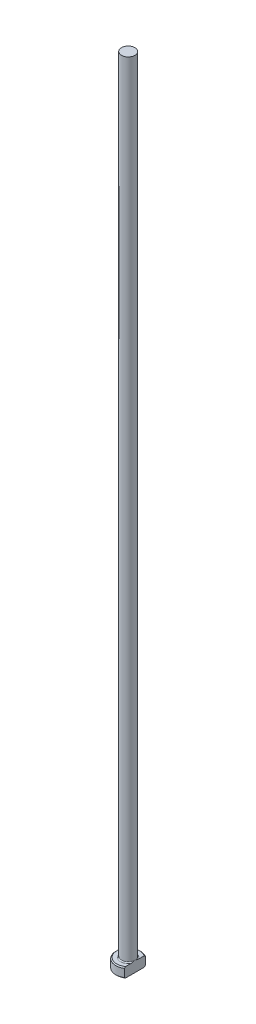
ISO-10303-21;
HEADER;
FILE_DESCRIPTION(('STEP AP214'),'2;1');
FILE_NAME('part.step','',(''),(''),'','','');
FILE_SCHEMA(('AUTOMOTIVE_DESIGN { 1 0 10303 214 1 1 1 1 }'));
ENDSEC;
DATA;
#1=APPLICATION_CONTEXT('core data for automotive mechanical design processes');
#2=APPLICATION_PROTOCOL_DEFINITION('international standard','automotive_design',2000,#1);
#3=PRODUCT_CONTEXT('',#1,'mechanical');
#4=PRODUCT('Part','Part','',(#3));
#5=PRODUCT_RELATED_PRODUCT_CATEGORY('part','',(#4));
#6=PRODUCT_DEFINITION_FORMATION('','',#4);
#7=PRODUCT_DEFINITION_CONTEXT('part definition',#1,'design');
#8=PRODUCT_DEFINITION('design','',#6,#7);
#9=PRODUCT_DEFINITION_SHAPE('','',#8);
#10=(LENGTH_UNIT() NAMED_UNIT(*) SI_UNIT(.MILLI.,.METRE.));
#11=(NAMED_UNIT(*) PLANE_ANGLE_UNIT() SI_UNIT($,.RADIAN.));
#12=(NAMED_UNIT(*) SI_UNIT($,.STERADIAN.) SOLID_ANGLE_UNIT());
#13=UNCERTAINTY_MEASURE_WITH_UNIT(LENGTH_MEASURE(1.E-05),#10,'distance_accuracy_value','');
#14=(GEOMETRIC_REPRESENTATION_CONTEXT(3) GLOBAL_UNCERTAINTY_ASSIGNED_CONTEXT((#13)) GLOBAL_UNIT_ASSIGNED_CONTEXT((#10,
#11,#12)) REPRESENTATION_CONTEXT('',''));
#15=CARTESIAN_POINT('',(0.,0.,0.));
#16=DIRECTION('',(0.,0.,1.));
#17=DIRECTION('',(1.,0.,0.));
#18=AXIS2_PLACEMENT_3D('',#15,#16,#17);
#19=CARTESIAN_POINT('',(0.,0.,0.));
#20=DIRECTION('',(0.,-1.,0.));
#21=DIRECTION('',(0.,0.,-1.));
#22=AXIS2_PLACEMENT_3D('',#19,#20,#21);
#23=PLANE('',#22);
#24=CARTESIAN_POINT('',(0.,0.,0.));
#25=DIRECTION('',(0.,-1.,0.));
#26=DIRECTION('',(0.,0.,-1.));
#27=AXIS2_PLACEMENT_3D('',#24,#25,#26);
#28=CIRCLE('',#27,2.29999999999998);
#29=CARTESIAN_POINT('',(1.34999999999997,0.,1.86212244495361));
#30=VERTEX_POINT('',#29);
#31=CARTESIAN_POINT('',(1.34999999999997,0.,-1.86212244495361));
#32=VERTEX_POINT('',#31);
#33=EDGE_CURVE('E98',#30,#32,#28,.T.);
#34=ORIENTED_EDGE('',*,*,#33,.T.);
#35=DIRECTION('',(0.,0.,1.));
#36=VECTOR('',#35,1.);
#37=CARTESIAN_POINT('',(1.34999999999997,0.,-2.10416254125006));
#38=LINE('',#37,#36);
#39=EDGE_CURVE('E83',#32,#30,#38,.T.);
#40=ORIENTED_EDGE('',*,*,#39,.T.);
#41=EDGE_LOOP('',(#34,#40));
#42=FACE_BOUND('',#41,.T.);
#43=ADVANCED_FACE('F32',(#42),#23,.T.);
#44=CARTESIAN_POINT('',(0.,259.958771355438,0.));
#45=DIRECTION('',(0.,1.,0.));
#46=DIRECTION('',(0.,0.,1.));
#47=AXIS2_PLACEMENT_3D('',#44,#45,#46);
#48=CYLINDRICAL_SURFACE('',#47,2.49999999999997);
#49=CARTESIAN_POINT('',(0.,1.79999999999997,0.));
#50=DIRECTION('',(0.,1.,0.));
#51=DIRECTION('',(0.,0.,1.));
#52=AXIS2_PLACEMENT_3D('',#49,#50,#51);
#53=CIRCLE('',#52,2.49999999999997);
#54=CARTESIAN_POINT('',(1.34999999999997,1.79999999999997,2.10416254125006));
#55=VERTEX_POINT('',#54);
#56=CARTESIAN_POINT('',(1.34999999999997,1.79999999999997,-2.10416254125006));
#57=VERTEX_POINT('',#56);
#58=EDGE_CURVE('E104',#55,#57,#53,.F.);
#59=ORIENTED_EDGE('',*,*,#58,.T.);
#60=DIRECTION('',(0.,-1.,0.));
#61=VECTOR('',#60,1.);
#62=CARTESIAN_POINT('',(1.34999999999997,160.,-2.10416254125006));
#63=LINE('',#62,#61);
#64=CARTESIAN_POINT('',(1.34999999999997,0.199999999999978,-2.10416254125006));
#65=VERTEX_POINT('',#64);
#66=EDGE_CURVE('E183',#57,#65,#63,.T.);
#67=ORIENTED_EDGE('',*,*,#66,.T.);
#68=CARTESIAN_POINT('',(0.,0.199999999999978,0.));
#69=DIRECTION('',(0.,-1.,0.));
#70=DIRECTION('',(0.,0.,-1.));
#71=AXIS2_PLACEMENT_3D('',#68,#69,#70);
#72=CIRCLE('',#71,2.49999999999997);
#73=CARTESIAN_POINT('',(1.34999999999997,0.199999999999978,2.10416254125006));
#74=VERTEX_POINT('',#73);
#75=EDGE_CURVE('E100',#65,#74,#72,.F.);
#76=ORIENTED_EDGE('',*,*,#75,.T.);
#77=DIRECTION('',(0.,-1.,0.));
#78=VECTOR('',#77,1.);
#79=CARTESIAN_POINT('',(1.34999999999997,160.,2.10416254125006));
#80=LINE('',#79,#78);
#81=EDGE_CURVE('E93',#55,#74,#80,.T.);
#82=ORIENTED_EDGE('',*,*,#81,.F.);
#83=EDGE_LOOP('',(#59,#67,#76,#82));
#84=FACE_BOUND('',#83,.T.);
#85=ADVANCED_FACE('F158',(#84),#48,.T.);
#86=CARTESIAN_POINT('',(-2.49999999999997,2.,0.));
#87=DIRECTION('',(0.,1.,0.));
#88=DIRECTION('',(0.,0.,1.));
#89=AXIS2_PLACEMENT_3D('',#86,#87,#88);
#90=PLANE('',#89);
#91=CARTESIAN_POINT('',(0.,2.,0.));
#92=DIRECTION('',(0.,1.,0.));
#93=DIRECTION('',(0.,0.,1.));
#94=AXIS2_PLACEMENT_3D('',#91,#92,#93);
#95=CIRCLE('',#94,2.29999999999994);
#96=CARTESIAN_POINT('',(1.34999999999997,2.,-1.86212244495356));
#97=VERTEX_POINT('',#96);
#98=CARTESIAN_POINT('',(1.34999999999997,2.,1.86212244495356));
#99=VERTEX_POINT('',#98);
#100=EDGE_CURVE('E178',#97,#99,#95,.T.);
#101=ORIENTED_EDGE('',*,*,#100,.T.);
#102=DIRECTION('',(0.,0.,-1.));
#103=VECTOR('',#102,1.);
#104=CARTESIAN_POINT('',(1.34999999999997,2.,0.));
#105=LINE('',#104,#103);
#106=CARTESIAN_POINT('',(1.34999999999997,1.99999999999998,0.761577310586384));
#107=VERTEX_POINT('',#106);
#108=EDGE_CURVE('E57',#99,#107,#105,.T.);
#109=ORIENTED_EDGE('',*,*,#108,.T.);
#110=CARTESIAN_POINT('',(0.,2.,0.));
#111=DIRECTION('',(0.,1.,0.));
#112=DIRECTION('',(0.,0.,1.));
#113=AXIS2_PLACEMENT_3D('',#110,#111,#112);
#114=CIRCLE('',#113,1.54999999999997);
#115=CARTESIAN_POINT('',(1.34999999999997,1.99999999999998,-0.761577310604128));
#116=VERTEX_POINT('',#115);
#117=EDGE_CURVE('E107',#107,#116,#114,.F.);
#118=ORIENTED_EDGE('',*,*,#117,.T.);
#119=EDGE_CURVE('E136',#116,#97,#105,.T.);
#120=ORIENTED_EDGE('',*,*,#119,.T.);
#121=EDGE_LOOP('',(#101,#109,#118,#120));
#122=FACE_BOUND('',#121,.T.);
#123=ADVANCED_FACE('F147',(#122),#90,.T.);
#124=CARTESIAN_POINT('',(0.,2.,0.));
#125=DIRECTION('',(0.,-1.,0.));
#126=DIRECTION('',(0.,0.,-1.));
#127=AXIS2_PLACEMENT_3D('',#124,#125,#126);
#128=CONICAL_SURFACE('',#127,2.29999999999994,0.785398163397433);
#129=ORIENTED_EDGE('',*,*,#58,.F.);
#130=CARTESIAN_POINT('',(1.34999999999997,-0.524919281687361,4.63220747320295));
#131=CARTESIAN_POINT('',(1.34999999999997,-0.437609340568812,4.54126266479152));
#132=CARTESIAN_POINT('',(1.34999999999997,-0.350401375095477,4.45021982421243));
#133=CARTESIAN_POINT('',(1.34999999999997,-0.176235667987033,4.26789371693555));
#134=CARTESIAN_POINT('',(1.34999999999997,-0.0892779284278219,4.17661044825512));
#135=CARTESIAN_POINT('',(1.34999999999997,0.171198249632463,3.90228319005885));
#136=CARTESIAN_POINT('',(1.34999999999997,0.344269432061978,3.71881394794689));
#137=CARTESIAN_POINT('',(1.34999999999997,0.686339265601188,3.35265578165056));
#138=CARTESIAN_POINT('',(1.34999999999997,0.855361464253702,3.16998895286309));
#139=CARTESIAN_POINT('',(1.34999999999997,1.10676804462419,2.89407002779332));
#140=CARTESIAN_POINT('',(1.34999999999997,1.19021072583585,2.80178299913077));
#141=CARTESIAN_POINT('',(1.34999999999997,1.35616107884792,2.61637299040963));
#142=CARTESIAN_POINT('',(1.34999999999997,1.43866876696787,2.52325002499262));
#143=CARTESIAN_POINT('',(1.34999999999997,1.58666506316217,2.35393986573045));
#144=CARTESIAN_POINT('',(1.34999999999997,1.65237203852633,2.27794381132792));
#145=CARTESIAN_POINT('',(1.34999999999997,1.78272599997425,2.12503384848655));
#146=CARTESIAN_POINT('',(1.34999999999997,1.8473728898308,2.04811985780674));
#147=CARTESIAN_POINT('',(1.34999999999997,1.97578051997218,1.89247191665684));
#148=CARTESIAN_POINT('',(1.34999999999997,2.03952939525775,1.81372814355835));
#149=CARTESIAN_POINT('',(1.34999999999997,2.16502964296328,1.6546866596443));
#150=CARTESIAN_POINT('',(1.34999999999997,2.22678149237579,1.57438932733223));
#151=CARTESIAN_POINT('',(1.34999999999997,2.34821109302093,1.41068778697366));
#152=CARTESIAN_POINT('',(1.34999999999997,2.40785394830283,1.32725749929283));
#153=CARTESIAN_POINT('',(1.34999999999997,2.52292072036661,1.15733795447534));
#154=CARTESIAN_POINT('',(1.34999999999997,2.57833930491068,1.07084502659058));
#155=CARTESIAN_POINT('',(1.34999999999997,2.68200172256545,0.894688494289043));
#156=CARTESIAN_POINT('',(1.34999999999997,2.73030792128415,0.805062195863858));
#157=CARTESIAN_POINT('',(1.34999999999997,2.81628592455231,0.620872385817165));
#158=CARTESIAN_POINT('',(1.34999999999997,2.85398889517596,0.52632433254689));
#159=CARTESIAN_POINT('',(1.34999999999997,2.89712682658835,0.383943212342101));
#160=CARTESIAN_POINT('',(1.34999999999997,2.90904798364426,0.338082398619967));
#161=CARTESIAN_POINT('',(1.34999999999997,2.92861548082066,0.245444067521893));
#162=CARTESIAN_POINT('',(1.34999999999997,2.93626244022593,0.198666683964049));
#163=CARTESIAN_POINT('',(1.34999999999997,2.94673600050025,0.104809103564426));
#164=CARTESIAN_POINT('',(1.34999999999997,2.94958722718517,0.0577317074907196));
#165=CARTESIAN_POINT('',(1.34999999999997,2.95032901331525,-0.0364641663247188));
#166=CARTESIAN_POINT('',(1.34999999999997,2.94821949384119,-0.0835826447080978));
#167=CARTESIAN_POINT('',(1.34999999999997,2.93922391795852,-0.177115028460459));
#168=CARTESIAN_POINT('',(1.34999999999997,2.932361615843,-0.223531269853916));
#169=CARTESIAN_POINT('',(1.34999999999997,2.91435204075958,-0.315528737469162));
#170=CARTESIAN_POINT('',(1.34999999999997,2.90320298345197,-0.361109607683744));
#171=CARTESIAN_POINT('',(1.34999999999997,2.8771578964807,-0.451518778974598));
#172=CARTESIAN_POINT('',(1.34999999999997,2.86223608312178,-0.496339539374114));
#173=CARTESIAN_POINT('',(1.34999999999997,2.82934295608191,-0.584823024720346));
#174=CARTESIAN_POINT('',(1.34999999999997,2.81137212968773,-0.628485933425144));
#175=CARTESIAN_POINT('',(1.34999999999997,2.75847247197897,-0.747269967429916));
#176=CARTESIAN_POINT('',(1.34999999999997,2.7209858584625,-0.821247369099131));
#177=CARTESIAN_POINT('',(1.34999999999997,2.64086295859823,-0.96638321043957));
#178=CARTESIAN_POINT('',(1.34999999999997,2.59822112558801,-1.03753850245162));
#179=CARTESIAN_POINT('',(1.34999999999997,2.50923184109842,-1.17783613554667));
#180=CARTESIAN_POINT('',(1.34999999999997,2.46287145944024,-1.24697020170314));
#181=CARTESIAN_POINT('',(1.34999999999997,2.36764461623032,-1.38343072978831));
#182=CARTESIAN_POINT('',(1.34999999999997,2.31877921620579,-1.45075793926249));
#183=CARTESIAN_POINT('',(1.34999999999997,2.21858850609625,-1.58486082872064));
#184=CARTESIAN_POINT('',(1.34999999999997,2.16724014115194,-1.65161920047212));
#185=CARTESIAN_POINT('',(1.34999999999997,2.06312993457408,-1.78402712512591));
#186=CARTESIAN_POINT('',(1.34999999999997,2.01036799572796,-1.8496766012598));
#187=CARTESIAN_POINT('',(1.34999999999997,1.85072242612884,-2.04502635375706));
#188=CARTESIAN_POINT('',(1.34999999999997,1.74225068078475,-2.17342678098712));
#189=CARTESIAN_POINT('',(1.34999999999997,1.54426345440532,-2.4029598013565));
#190=CARTESIAN_POINT('',(1.34999999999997,1.45520943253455,-2.50449462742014));
#191=CARTESIAN_POINT('',(1.34999999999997,1.27587070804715,-2.7064765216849));
#192=CARTESIAN_POINT('',(1.34999999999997,1.18558597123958,-2.80692355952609));
#193=CARTESIAN_POINT('',(1.34999999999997,0.913238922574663,-3.10722245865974));
#194=CARTESIAN_POINT('',(1.34999999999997,0.729836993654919,-3.30585698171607));
#195=CARTESIAN_POINT('',(1.34999999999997,0.368419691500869,-3.6931549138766));
#196=CARTESIAN_POINT('',(1.34999999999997,0.190487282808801,-3.88189615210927));
#197=CARTESIAN_POINT('',(1.34999999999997,-0.0772724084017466,-4.16399820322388));
#198=CARTESIAN_POINT('',(1.34999999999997,-0.166621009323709,-4.2578138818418));
#199=CARTESIAN_POINT('',(1.34999999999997,-0.345583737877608,-4.44518993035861));
#200=CARTESIAN_POINT('',(1.34999999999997,-0.435197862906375,-4.53875030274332));
#201=CARTESIAN_POINT('',(1.34999999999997,-0.52491928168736,-4.63220747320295));
#202=B_SPLINE_CURVE_WITH_KNOTS('',3,(#130,#131,#132,#133,#134,#135,#136,#137,#138,#139,#140,
#141,#142,#143,#144,#145,#146,#147,#148,#149,#150,#151,#152,#153,#154,#155,#156,#157,#158,#159,
#160,#161,#162,#163,#164,#165,#166,#167,#168,#169,#170,#171,#172,#173,#174,#175,#176,#177,#178,
#179,#180,#181,#182,#183,#184,#185,#186,#187,#188,#189,#190,#191,#192,#193,#194,#195,#196,#197,
#198,#199,#200,#201),.UNSPECIFIED.,.F.,.F.,(4,2,2,2,2,2,2,2,2,2,2,2,2,2,2,2,2,2,2,2,2,2,2,2,2,2,
2,2,2,2,2,2,2,2,2,4),(0.,0.378214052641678,0.756431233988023,1.51308288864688,2.2596674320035,
2.63291386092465,3.00615376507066,3.30753536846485,3.60894417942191,3.91286335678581,
4.21670939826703,4.52429630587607,4.83226525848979,5.13734835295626,5.4415251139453,
5.58351223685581,5.72547878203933,5.86671408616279,6.00795163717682,6.14848833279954,
6.28908358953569,6.43066697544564,6.57222775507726,6.82069043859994,7.06942287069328,
7.31906118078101,7.56859456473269,7.82123528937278,8.07389343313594,8.57808208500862,
8.98323970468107,9.38840860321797,10.1994443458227,10.9776078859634,11.3662730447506,
11.7549344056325),.UNSPECIFIED.);
#203=EDGE_CURVE('E135',#55,#99,#202,.T.);
#204=ORIENTED_EDGE('',*,*,#203,.T.);
#205=ORIENTED_EDGE('',*,*,#100,.F.);
#206=EDGE_CURVE('E127',#97,#57,#202,.T.);
#207=ORIENTED_EDGE('',*,*,#206,.T.);
#208=EDGE_LOOP('',(#129,#204,#205,#207));
#209=FACE_BOUND('',#208,.T.);
#210=ADVANCED_FACE('F143',(#209),#128,.T.);
#211=CARTESIAN_POINT('',(0.,0.199999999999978,0.));
#212=DIRECTION('',(0.,1.,0.));
#213=DIRECTION('',(0.,0.,1.));
#214=AXIS2_PLACEMENT_3D('',#211,#212,#213);
#215=CONICAL_SURFACE('',#214,2.49999999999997,0.785398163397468);
#216=ORIENTED_EDGE('',*,*,#75,.F.);
#217=CARTESIAN_POINT('',(1.34999999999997,2.52491928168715,-4.63220747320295));
#218=CARTESIAN_POINT('',(1.34999999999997,2.4376093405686,-4.54126266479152));
#219=CARTESIAN_POINT('',(1.34999999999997,2.35040137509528,-4.45021982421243));
#220=CARTESIAN_POINT('',(1.34999999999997,2.17623566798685,-4.26789371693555));
#221=CARTESIAN_POINT('',(1.34999999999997,2.08927792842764,-4.17661044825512));
#222=CARTESIAN_POINT('',(1.34999999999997,1.82880175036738,-3.90228319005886));
#223=CARTESIAN_POINT('',(1.34999999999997,1.65573056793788,-3.7188139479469));
#224=CARTESIAN_POINT('',(1.34999999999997,1.3136607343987,-3.35265578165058));
#225=CARTESIAN_POINT('',(1.34999999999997,1.1446385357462,-3.16998895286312));
#226=CARTESIAN_POINT('',(1.34999999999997,0.89323195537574,-2.89407002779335));
#227=CARTESIAN_POINT('',(1.34999999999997,0.809789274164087,-2.8017829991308));
#228=CARTESIAN_POINT('',(1.34999999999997,0.64383892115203,-2.61637299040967));
#229=CARTESIAN_POINT('',(1.34999999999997,0.561331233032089,-2.52325002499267));
#230=CARTESIAN_POINT('',(1.34999999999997,0.413334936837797,-2.35393986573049));
#231=CARTESIAN_POINT('',(1.34999999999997,0.347627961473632,-2.27794381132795));
#232=CARTESIAN_POINT('',(1.34999999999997,0.217274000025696,-2.12503384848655));
#233=CARTESIAN_POINT('',(1.34999999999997,0.152627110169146,-2.04811985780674));
#234=CARTESIAN_POINT('',(1.34999999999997,0.0242194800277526,-1.89247191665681));
#235=CARTESIAN_POINT('',(1.34999999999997,-0.03952939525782,-1.8137281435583));
#236=CARTESIAN_POINT('',(1.34999999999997,-0.165029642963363,-1.65468665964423));
#237=CARTESIAN_POINT('',(1.34999999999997,-0.226781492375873,-1.57438932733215));
#238=CARTESIAN_POINT('',(1.34999999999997,-0.348211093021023,-1.41068778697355));
#239=CARTESIAN_POINT('',(1.34999999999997,-0.407853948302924,-1.32725749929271));
#240=CARTESIAN_POINT('',(1.34999999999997,-0.522920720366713,-1.15733795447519));
#241=CARTESIAN_POINT('',(1.34999999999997,-0.578339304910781,-1.07084502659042));
#242=CARTESIAN_POINT('',(1.34999999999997,-0.682001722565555,-0.894688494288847));
#243=CARTESIAN_POINT('',(1.34999999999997,-0.730307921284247,-0.805062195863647));
#244=CARTESIAN_POINT('',(1.34999999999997,-0.816285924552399,-0.620872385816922));
#245=CARTESIAN_POINT('',(1.34999999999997,-0.853988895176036,-0.52632433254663));
#246=CARTESIAN_POINT('',(1.34999999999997,-0.897126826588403,-0.383943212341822));
#247=CARTESIAN_POINT('',(1.34999999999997,-0.909047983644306,-0.338082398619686));
#248=CARTESIAN_POINT('',(1.34999999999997,-0.928615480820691,-0.245444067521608));
#249=CARTESIAN_POINT('',(1.34999999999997,-0.936262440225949,-0.198666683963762));
#250=CARTESIAN_POINT('',(1.34999999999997,-0.946736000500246,-0.104809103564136));
#251=CARTESIAN_POINT('',(1.34999999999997,-0.949587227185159,-0.057731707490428));
#252=CARTESIAN_POINT('',(1.34999999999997,-0.950329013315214,0.0364641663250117));
#253=CARTESIAN_POINT('',(1.34999999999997,-0.948219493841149,0.0835826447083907));
#254=CARTESIAN_POINT('',(1.34999999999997,-0.939223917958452,0.17711502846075));
#255=CARTESIAN_POINT('',(1.34999999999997,-0.932361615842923,0.223531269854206));
#256=CARTESIAN_POINT('',(1.34999999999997,-0.914352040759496,0.315528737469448));
#257=CARTESIAN_POINT('',(1.34999999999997,-0.903202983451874,0.361109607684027));
#258=CARTESIAN_POINT('',(1.34999999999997,-0.877157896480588,0.451518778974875));
#259=CARTESIAN_POINT('',(1.34999999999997,-0.862236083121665,0.496339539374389));
#260=CARTESIAN_POINT('',(1.34999999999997,-0.82934295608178,0.584823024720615));
#261=CARTESIAN_POINT('',(1.34999999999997,-0.811372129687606,0.628485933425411));
#262=CARTESIAN_POINT('',(1.34999999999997,-0.758472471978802,0.747269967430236));
#263=CARTESIAN_POINT('',(1.34999999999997,-0.720985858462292,0.821247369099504));
#264=CARTESIAN_POINT('',(1.34999999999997,-0.640862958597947,0.966383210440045));
#265=CARTESIAN_POINT('',(1.34999999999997,-0.598221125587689,1.03753850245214));
#266=CARTESIAN_POINT('',(1.34999999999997,-0.509231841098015,1.1778361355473));
#267=CARTESIAN_POINT('',(1.34999999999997,-0.462871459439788,1.24697020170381));
#268=CARTESIAN_POINT('',(1.34999999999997,-0.367644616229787,1.38343072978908));
#269=CARTESIAN_POINT('',(1.34999999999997,-0.318779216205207,1.45075793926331));
#270=CARTESIAN_POINT('',(1.34999999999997,-0.218588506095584,1.58486082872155));
#271=CARTESIAN_POINT('',(1.34999999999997,-0.167240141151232,1.65161920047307));
#272=CARTESIAN_POINT('',(1.34999999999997,-0.0631299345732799,1.78402712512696));
#273=CARTESIAN_POINT('',(1.34999999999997,-0.0103679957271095,1.84967660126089));
#274=CARTESIAN_POINT('',(1.34999999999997,0.14927757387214,2.0450263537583));
#275=CARTESIAN_POINT('',(1.34999999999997,0.257749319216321,2.17342678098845));
#276=CARTESIAN_POINT('',(1.34999999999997,0.455736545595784,2.40295980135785));
#277=CARTESIAN_POINT('',(1.34999999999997,0.544790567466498,2.50449462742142));
#278=CARTESIAN_POINT('',(1.34999999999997,0.724129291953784,2.70647652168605));
#279=CARTESIAN_POINT('',(1.34999999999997,0.814414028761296,2.80692355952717));
#280=CARTESIAN_POINT('',(1.34999999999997,1.08676107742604,3.10722245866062));
#281=CARTESIAN_POINT('',(1.34999999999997,1.27016300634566,3.30585698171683));
#282=CARTESIAN_POINT('',(1.34999999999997,1.63158030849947,3.69315491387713));
#283=CARTESIAN_POINT('',(1.34999999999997,1.80951271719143,3.88189615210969));
#284=CARTESIAN_POINT('',(1.34999999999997,2.07727240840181,4.16399820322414));
#285=CARTESIAN_POINT('',(1.34999999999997,2.16662100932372,4.25781388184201));
#286=CARTESIAN_POINT('',(1.34999999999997,2.3455837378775,4.44518993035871));
#287=CARTESIAN_POINT('',(1.34999999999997,2.43519786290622,4.53875030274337));
#288=CARTESIAN_POINT('',(1.34999999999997,2.52491928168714,4.63220747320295));
#289=B_SPLINE_CURVE_WITH_KNOTS('',3,(#217,#218,#219,#220,#221,#222,#223,#224,#225,#226,#227,
#228,#229,#230,#231,#232,#233,#234,#235,#236,#237,#238,#239,#240,#241,#242,#243,#244,#245,#246,
#247,#248,#249,#250,#251,#252,#253,#254,#255,#256,#257,#258,#259,#260,#261,#262,#263,#264,#265,
#266,#267,#268,#269,#270,#271,#272,#273,#274,#275,#276,#277,#278,#279,#280,#281,#282,#283,#284,
#285,#286,#287,#288),.UNSPECIFIED.,.F.,.F.,(4,2,2,2,2,2,2,2,2,2,2,2,2,2,2,2,2,2,2,2,2,2,2,2,2,2,
2,2,2,2,2,2,2,2,2,4),(0.,0.378214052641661,0.756431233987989,1.51308288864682,2.25966743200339,
2.63291386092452,3.0061537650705,3.30753536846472,3.60894417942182,3.91286335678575,
4.21670939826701,4.52429630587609,4.83226525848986,5.13734835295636,5.44152511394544,
5.58351223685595,5.72547878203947,5.86671408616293,6.00795163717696,6.14848833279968,
6.28908358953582,6.43066697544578,6.57222775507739,6.82069043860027,7.0694228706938,
7.31906118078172,7.56859456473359,7.82123528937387,8.07389343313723,8.57808208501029,
8.98323970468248,9.38840860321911,10.1994443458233,10.9776078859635,11.3662730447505,
11.7549344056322),.UNSPECIFIED.);
#290=EDGE_CURVE('E86',#65,#32,#289,.T.);
#291=ORIENTED_EDGE('',*,*,#290,.T.);
#292=ORIENTED_EDGE('',*,*,#33,.F.);
#293=EDGE_CURVE('E89',#30,#74,#289,.T.);
#294=ORIENTED_EDGE('',*,*,#293,.T.);
#295=EDGE_LOOP('',(#216,#291,#292,#294));
#296=FACE_BOUND('',#295,.T.);
#297=ADVANCED_FACE('F97',(#296),#215,.T.);
#298=CARTESIAN_POINT('',(0.,2.19999999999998,0.));
#299=DIRECTION('',(0.,1.,0.));
#300=DIRECTION('',(0.,0.,1.));
#301=AXIS2_PLACEMENT_3D('',#298,#299,#300);
#302=TOROIDAL_SURFACE('',#301,1.54999999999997,0.2);
#303=CARTESIAN_POINT('',(1.34999999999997,2.19999999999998,0.));
#304=CARTESIAN_POINT('',(1.34999999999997,2.20000051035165,-6.93386413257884E-11));
#305=CARTESIAN_POINT('',(1.34999999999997,2.20000102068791,-1.14040096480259E-07));
#306=CARTESIAN_POINT('',(1.34999999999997,2.2000020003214,-4.70904764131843E-07));
#307=CARTESIAN_POINT('',(1.34999999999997,2.20000246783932,-7.1771368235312E-07));
#308=CARTESIAN_POINT('',(1.34999999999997,2.20000340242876,-1.30966222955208E-06));
#309=CARTESIAN_POINT('',(1.34999999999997,2.20000386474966,-1.662182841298E-06));
#310=CARTESIAN_POINT('',(1.34999999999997,2.20000473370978,-2.41969342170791E-06));
#311=CARTESIAN_POINT('',(1.34999999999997,2.20000514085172,-2.82413349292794E-06));
#312=CARTESIAN_POINT('',(1.34999999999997,2.20000651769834,-4.28387658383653E-06));
#313=CARTESIAN_POINT('',(1.34999999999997,2.20000741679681,-5.40686565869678E-06));
#314=CARTESIAN_POINT('',(1.34999999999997,2.20000900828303,-7.71855157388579E-06));
#315=CARTESIAN_POINT('',(1.34999999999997,2.20000970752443,-8.90279582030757E-06));
#316=CARTESIAN_POINT('',(1.34999999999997,2.20001236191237,-1.3560882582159E-05));
#317=CARTESIAN_POINT('',(1.34999999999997,2.20001418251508,-1.71153577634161E-05));
#318=CARTESIAN_POINT('',(1.34999999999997,2.20001713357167,-2.4096378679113E-05));
#319=CARTESIAN_POINT('',(1.34999999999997,2.20001831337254,-2.75026560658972E-05));
#320=CARTESIAN_POINT('',(1.34999999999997,2.20002337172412,-4.21136205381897E-05));
#321=CARTESIAN_POINT('',(1.34999999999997,2.20002724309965,-5.33128878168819E-05));
#322=CARTESIAN_POINT('',(1.34999999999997,2.20003341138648,-7.4213259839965E-05));
#323=CARTESIAN_POINT('',(1.34999999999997,2.20003586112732,-8.38672294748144E-05));
#324=CARTESIAN_POINT('',(1.34999999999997,2.20005538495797,-0.000154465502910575));
#325=CARTESIAN_POINT('',(1.34999999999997,2.20008043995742,-0.000212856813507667));
#326=CARTESIAN_POINT('',(1.34999999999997,2.20017457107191,-0.000440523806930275));
#327=CARTESIAN_POINT('',(1.34999999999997,2.2002377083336,-0.000611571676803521));
#328=CARTESIAN_POINT('',(1.34999999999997,2.20048725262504,-0.00127779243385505));
#329=CARTESIAN_POINT('',(1.34999999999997,2.2006798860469,-0.00177115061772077));
#330=CARTESIAN_POINT('',(1.34999999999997,2.20146612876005,-0.00379437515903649));
#331=CARTESIAN_POINT('',(1.34999999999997,2.20205268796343,-0.0053262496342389));
#332=CARTESIAN_POINT('',(1.34999999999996,2.20919457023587,-0.0239661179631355));
#333=CARTESIAN_POINT('',(1.34999999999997,2.21579238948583,-0.0410623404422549));
#334=CARTESIAN_POINT('',(1.34999999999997,2.22866578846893,-0.074650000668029));
#335=CARTESIAN_POINT('',(1.34999999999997,2.23494426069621,-0.0911404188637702));
#336=CARTESIAN_POINT('',(1.34999999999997,2.24814459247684,-0.126093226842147));
#337=CARTESIAN_POINT('',(1.34999999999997,2.25505545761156,-0.144559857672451));
#338=CARTESIAN_POINT('',(1.34999999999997,2.26876393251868,-0.181748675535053));
#339=CARTESIAN_POINT('',(1.34999999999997,2.27555967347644,-0.200471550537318));
#340=CARTESIAN_POINT('',(1.34999999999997,2.29202668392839,-0.246805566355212));
#341=CARTESIAN_POINT('',(1.34999999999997,2.30155256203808,-0.274468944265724));
#342=CARTESIAN_POINT('',(1.34999999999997,2.31961149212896,-0.329392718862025));
#343=CARTESIAN_POINT('',(1.34999999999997,2.32816274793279,-0.356647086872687));
#344=CARTESIAN_POINT('',(1.34999999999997,2.34540016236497,-0.415248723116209));
#345=CARTESIAN_POINT('',(1.34999999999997,2.35394063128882,-0.446639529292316));
#346=CARTESIAN_POINT('',(1.34999999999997,2.36937995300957,-0.510082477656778));
#347=CARTESIAN_POINT('',(1.34999999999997,2.3762658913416,-0.542137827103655));
#348=CARTESIAN_POINT('',(1.34999999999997,2.38814240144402,-0.608749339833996));
#349=CARTESIAN_POINT('',(1.34999999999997,2.39298194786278,-0.64333337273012));
#350=CARTESIAN_POINT('',(1.34999999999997,2.39922141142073,-0.712731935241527));
#351=CARTESIAN_POINT('',(1.34999999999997,2.40063314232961,-0.747545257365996));
#352=CARTESIAN_POINT('',(1.34999999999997,2.39899063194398,-0.811125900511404));
#353=CARTESIAN_POINT('',(1.34999999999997,2.39665955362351,-0.839907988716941));
#354=CARTESIAN_POINT('',(1.34999999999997,2.3878724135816,-0.896503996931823));
#355=CARTESIAN_POINT('',(1.34999999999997,2.3814773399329,-0.924325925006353));
#356=CARTESIAN_POINT('',(1.34999999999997,2.36777648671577,-0.964713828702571));
#357=CARTESIAN_POINT('',(1.34999999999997,2.36251387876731,-0.977971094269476));
#358=CARTESIAN_POINT('',(1.34999999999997,2.35035650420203,-1.00376929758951));
#359=CARTESIAN_POINT('',(1.34999999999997,2.34345879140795,-1.01630889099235));
#360=CARTESIAN_POINT('',(1.34999999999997,2.329139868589,-1.03811283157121));
#361=CARTESIAN_POINT('',(1.34999999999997,2.32201405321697,-1.04756908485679));
#362=CARTESIAN_POINT('',(1.34999999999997,2.30635495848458,-1.06523411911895));
#363=CARTESIAN_POINT('',(1.34999999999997,2.29782508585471,-1.07344582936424));
#364=CARTESIAN_POINT('',(1.34999999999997,2.28196145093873,-1.08598464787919));
#365=CARTESIAN_POINT('',(1.34999999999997,2.274977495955,-1.09075233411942));
#366=CARTESIAN_POINT('',(1.34999999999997,2.26033012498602,-1.09910941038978));
#367=CARTESIAN_POINT('',(1.34999999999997,2.25266710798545,-1.10269948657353));
#368=CARTESIAN_POINT('',(1.34999999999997,2.23673989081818,-1.1084681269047));
#369=CARTESIAN_POINT('',(1.34999999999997,2.22847092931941,-1.1106337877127));
#370=CARTESIAN_POINT('',(1.34999999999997,2.21166869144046,-1.11329753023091));
#371=CARTESIAN_POINT('',(1.34999999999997,2.20313564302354,-1.11379701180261));
#372=CARTESIAN_POINT('',(1.34999999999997,2.18727799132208,-1.11313057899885));
#373=CARTESIAN_POINT('',(1.34999999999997,2.17994351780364,-1.11217719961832));
#374=CARTESIAN_POINT('',(1.34999999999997,2.16553907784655,-1.10905798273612));
#375=CARTESIAN_POINT('',(1.34999999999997,2.15846915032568,-1.10689196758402));
#376=CARTESIAN_POINT('',(1.34999999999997,2.14470559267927,-1.10147189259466));
#377=CARTESIAN_POINT('',(1.34999999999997,2.13801509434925,-1.09820998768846));
#378=CARTESIAN_POINT('',(1.34999999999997,2.12516220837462,-1.0907816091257));
#379=CARTESIAN_POINT('',(1.34999999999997,2.119000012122,-1.08661480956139));
#380=CARTESIAN_POINT('',(1.34999999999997,2.10390058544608,-1.07497116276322));
#381=CARTESIAN_POINT('',(1.34999999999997,2.09537574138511,-1.06695869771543));
#382=CARTESIAN_POINT('',(1.34999999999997,2.07969650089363,-1.04968237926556));
#383=CARTESIAN_POINT('',(1.34999999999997,2.07254642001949,-1.04041473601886));
#384=CARTESIAN_POINT('',(1.34999999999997,2.0559393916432,-1.01572772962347));
#385=CARTESIAN_POINT('',(1.34999999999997,2.04736349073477,-0.99971889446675));
#386=CARTESIAN_POINT('',(1.34999999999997,2.03274927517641,-0.966649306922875));
#387=CARTESIAN_POINT('',(1.34999999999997,2.02670979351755,-0.949589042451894));
#388=CARTESIAN_POINT('',(1.34999999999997,2.01301888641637,-0.902192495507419));
#389=CARTESIAN_POINT('',(1.34999999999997,2.00741820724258,-0.871270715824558));
#390=CARTESIAN_POINT('',(1.34999999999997,2.0006455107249,-0.808563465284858));
#391=CARTESIAN_POINT('',(1.34999999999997,1.99954416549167,-0.776772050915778));
#392=CARTESIAN_POINT('',(1.34999999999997,2.00095999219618,-0.704102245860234));
#393=CARTESIAN_POINT('',(1.34999999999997,2.00461462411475,-0.663252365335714));
#394=CARTESIAN_POINT('',(1.34999999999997,2.01597234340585,-0.582010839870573));
#395=CARTESIAN_POINT('',(1.34999999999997,2.02369178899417,-0.54162172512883));
#396=CARTESIAN_POINT('',(1.34999999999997,2.04136563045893,-0.464405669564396));
#397=CARTESIAN_POINT('',(1.34999999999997,2.05111943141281,-0.427531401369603));
#398=CARTESIAN_POINT('',(1.34999999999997,2.07231971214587,-0.354637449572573));
#399=CARTESIAN_POINT('',(1.34999999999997,2.08375041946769,-0.318613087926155));
#400=CARTESIAN_POINT('',(1.34999999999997,2.1024239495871,-0.263006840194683));
#401=CARTESIAN_POINT('',(1.34999999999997,2.10925115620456,-0.243282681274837));
#402=CARTESIAN_POINT('',(1.34999999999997,2.12336489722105,-0.203437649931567));
#403=CARTESIAN_POINT('',(1.34999999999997,2.13065867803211,-0.183319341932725));
#404=CARTESIAN_POINT('',(1.34999999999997,2.14313587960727,-0.149463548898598));
#405=CARTESIAN_POINT('',(1.34999999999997,2.1482631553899,-0.135705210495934));
#406=CARTESIAN_POINT('',(1.34999999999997,2.15854219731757,-0.108353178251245));
#407=CARTESIAN_POINT('',(1.34999999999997,2.16369321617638,-0.0947592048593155));
#408=CARTESIAN_POINT('',(1.34999999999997,2.17349784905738,-0.0690071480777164));
#409=CARTESIAN_POINT('',(1.34999999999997,2.17814722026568,-0.0568473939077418));
#410=CARTESIAN_POINT('',(1.34999999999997,2.18766064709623,-0.0320803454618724));
#411=CARTESIAN_POINT('',(1.34999999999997,2.1925261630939,-0.019473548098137));
#412=CARTESIAN_POINT('',(1.34999999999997,2.19794687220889,-0.00532758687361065));
#413=CARTESIAN_POINT('',(1.34999999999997,2.19853287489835,-0.00379701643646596));
#414=CARTESIAN_POINT('',(1.34999999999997,2.19931897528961,-0.00177410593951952));
#415=CARTESIAN_POINT('',(1.34999999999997,2.19951199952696,-0.00127975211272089));
#416=CARTESIAN_POINT('',(1.34999999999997,2.19976201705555,-0.000612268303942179));
#417=CARTESIAN_POINT('',(1.34999999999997,2.19982525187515,-0.000440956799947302));
#418=CARTESIAN_POINT('',(1.34999999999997,2.19991951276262,-0.000212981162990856));
#419=CARTESIAN_POINT('',(1.34999999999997,2.19994458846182,-0.000154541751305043));
#420=CARTESIAN_POINT('',(1.34999999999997,2.19996412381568,-8.38889589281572E-05));
#421=CARTESIAN_POINT('',(1.34999999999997,2.19996657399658,-7.42314656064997E-05));
#422=CARTESIAN_POINT('',(1.34999999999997,2.1999727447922,-5.33232983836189E-05));
#423=CARTESIAN_POINT('',(1.34999999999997,2.19997661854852,-4.21198546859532E-05));
#424=CARTESIAN_POINT('',(1.34999999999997,2.19998167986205,-2.75042074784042E-05));
#425=CARTESIAN_POINT('',(1.34999999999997,2.19998286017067,-2.40973903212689E-05));
#426=CARTESIAN_POINT('',(1.34999999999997,2.19998581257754,-1.71153452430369E-05));
#427=CARTESIAN_POINT('',(1.34999999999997,2.19998763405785,-1.35604061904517E-05));
#428=CARTESIAN_POINT('',(1.34999999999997,2.19999028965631,-8.90187906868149E-06));
#429=CARTESIAN_POINT('',(1.34999999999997,2.19999098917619,-7.7175929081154E-06));
#430=CARTESIAN_POINT('',(1.34999999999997,2.19999258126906,-5.40587786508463E-06));
#431=CARTESIAN_POINT('',(1.34999999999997,2.19999348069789,-4.28290463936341E-06));
#432=CARTESIAN_POINT('',(1.34999999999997,2.19999485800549,-2.82324857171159E-06));
#433=CARTESIAN_POINT('',(1.34999999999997,2.19999526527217,-2.41884666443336E-06));
#434=CARTESIAN_POINT('',(1.34999999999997,2.19999613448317,-1.66143479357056E-06));
#435=CARTESIAN_POINT('',(1.34999999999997,2.19999659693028,-1.30897501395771E-06));
#436=CARTESIAN_POINT('',(1.34999999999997,2.19999753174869,-7.17173367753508E-07));
#437=CARTESIAN_POINT('',(1.34999999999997,2.19999799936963,-4.70447275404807E-07));
#438=CARTESIAN_POINT('',(1.34999999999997,2.19999897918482,-1.13784244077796E-07));
#439=CARTESIAN_POINT('',(1.34999999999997,2.19999948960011,6.93451898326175E-11));
#440=CARTESIAN_POINT('',(1.34999999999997,2.19999999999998,0.));
#441=B_SPLINE_CURVE_WITH_KNOTS('',3,(#303,#304,#305,#306,#307,#308,#309,#310,#311,#312,#313,
#314,#315,#316,#317,#318,#319,#320,#321,#322,#323,#324,#325,#326,#327,#328,#329,#330,#331,#332,
#333,#334,#335,#336,#337,#338,#339,#340,#341,#342,#343,#344,#345,#346,#347,#348,#349,#350,#351,
#352,#353,#354,#355,#356,#357,#358,#359,#360,#361,#362,#363,#364,#365,#366,#367,#368,#369,#370,
#371,#372,#373,#374,#375,#376,#377,#378,#379,#380,#381,#382,#383,#384,#385,#386,#387,#388,#389,
#390,#391,#392,#393,#394,#395,#396,#397,#398,#399,#400,#401,#402,#403,#404,#405,#406,#407,#408,
#409,#410,#411,#412,#413,#414,#415,#416,#417,#418,#419,#420,#421,#422,#423,#424,#425,#426,#427,
#428,#429,#430,#431,#432,#433,#434,#435,#436,#437,#438,#439,#440),.UNSPECIFIED.,.T.,.F.,(4,2,2,
2,2,2,2,2,2,2,2,2,2,2,2,2,2,2,2,2,2,2,2,2,2,2,2,2,2,2,2,2,2,2,2,2,2,2,2,2,2,2,2,2,2,2,2,2,2,2,2,
2,2,2,2,2,2,2,2,2,2,2,2,2,2,2,2,2,4),(0.,1.53064488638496E-06,3.1090904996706E-06,
4.84589729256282E-06,6.56562952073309E-06,1.08607277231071E-05,1.49832635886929E-05,
2.69283135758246E-05,3.77311402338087E-05,7.32737119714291E-05,0.000103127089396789,
0.000293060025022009,0.000840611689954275,0.00242879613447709,0.00735055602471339,
0.0623205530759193,0.115257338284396,0.174408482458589,0.234161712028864,0.321925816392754,
0.407605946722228,0.50516586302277,0.603464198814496,0.708107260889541,0.81238916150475,
0.898818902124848,0.983981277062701,1.02669027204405,1.0694768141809,1.10488501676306,
1.1402085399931,1.16548550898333,1.19074772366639,1.21623573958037,1.24170233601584,
1.26378399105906,1.28586888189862,1.30811536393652,1.33036987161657,1.36526774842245,
1.40027344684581,1.45444967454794,1.50860094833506,1.6023504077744,1.69756687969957,
1.82029471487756,1.94352026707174,2.05788606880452,2.17123799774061,2.23385323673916,
2.29805014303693,2.34209804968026,2.38570907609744,2.42476491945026,2.46530034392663,
2.47021786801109,2.47180925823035,2.47235765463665,2.4725477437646,2.47257760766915,
2.47261316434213,2.47262396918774,2.47263591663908,2.4726400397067,2.4726443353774,
2.47264605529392,2.47264779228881,2.47264937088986,2.4726509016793),.UNSPECIFIED.);
#442=CARTESIAN_POINT('',(1.34999999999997,2.19999999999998,0.));
#443=VERTEX_POINT('',#442);
#444=EDGE_CURVE('E11',#116,#443,#441,.T.);
#445=ORIENTED_EDGE('',*,*,#444,.F.);
#446=ORIENTED_EDGE('',*,*,#117,.F.);
#447=CARTESIAN_POINT('',(1.34999999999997,2.19999999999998,0.));
#448=CARTESIAN_POINT('',(1.34999999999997,2.19999948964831,6.93385670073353E-11));
#449=CARTESIAN_POINT('',(1.34999999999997,2.19999897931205,1.14040096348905E-07));
#450=CARTESIAN_POINT('',(1.34999999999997,2.19999799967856,4.7090476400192E-07));
#451=CARTESIAN_POINT('',(1.34999999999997,2.19999753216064,7.17713682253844E-07));
#452=CARTESIAN_POINT('',(1.34999999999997,2.1999965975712,1.30966222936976E-06));
#453=CARTESIAN_POINT('',(1.34999999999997,2.1999961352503,1.66218284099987E-06));
#454=CARTESIAN_POINT('',(1.34999999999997,2.19999526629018,2.41969342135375E-06));
#455=CARTESIAN_POINT('',(1.34999999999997,2.19999485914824,2.8241334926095E-06));
#456=CARTESIAN_POINT('',(1.34999999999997,2.19999348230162,4.28387658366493E-06));
#457=CARTESIAN_POINT('',(1.34999999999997,2.19999258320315,5.40686565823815E-06));
#458=CARTESIAN_POINT('',(1.34999999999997,2.19999099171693,7.71855157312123E-06));
#459=CARTESIAN_POINT('',(1.34999999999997,2.19999029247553,8.9027958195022E-06));
#460=CARTESIAN_POINT('',(1.34999999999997,2.1999876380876,1.35608825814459E-05));
#461=CARTESIAN_POINT('',(1.34999999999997,2.19998581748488,1.71153577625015E-05));
#462=CARTESIAN_POINT('',(1.34999999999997,2.19998286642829,2.40963786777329E-05));
#463=CARTESIAN_POINT('',(1.34999999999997,2.19998168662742,2.75026560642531E-05));
#464=CARTESIAN_POINT('',(1.34999999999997,2.19997662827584,4.21136205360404E-05));
#465=CARTESIAN_POINT('',(1.34999999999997,2.19997275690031,5.331288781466E-05));
#466=CARTESIAN_POINT('',(1.34999999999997,2.19996658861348,7.4213259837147E-05));
#467=CARTESIAN_POINT('',(1.34999999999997,2.19996413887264,8.38672294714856E-05));
#468=CARTESIAN_POINT('',(1.34999999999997,2.199944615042,0.000154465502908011));
#469=CARTESIAN_POINT('',(1.34999999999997,2.19991956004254,0.00021285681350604));
#470=CARTESIAN_POINT('',(1.34999999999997,2.19982542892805,0.000440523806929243));
#471=CARTESIAN_POINT('',(1.34999999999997,2.19976229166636,0.000611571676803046));
#472=CARTESIAN_POINT('',(1.34999999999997,2.19951274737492,0.0012777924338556));
#473=CARTESIAN_POINT('',(1.34999999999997,2.19932011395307,0.00177115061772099));
#474=CARTESIAN_POINT('',(1.34999999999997,2.19853387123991,0.00379437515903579));
#475=CARTESIAN_POINT('',(1.34999999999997,2.19794731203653,0.00532624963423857));
#476=CARTESIAN_POINT('',(1.34999999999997,2.1908054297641,0.0239661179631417));
#477=CARTESIAN_POINT('',(1.34999999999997,2.18420761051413,0.0410623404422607));
#478=CARTESIAN_POINT('',(1.34999999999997,2.17133421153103,0.0746500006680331));
#479=CARTESIAN_POINT('',(1.34999999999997,2.16505573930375,0.0911404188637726));
#480=CARTESIAN_POINT('',(1.34999999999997,2.15185540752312,0.126093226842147));
#481=CARTESIAN_POINT('',(1.34999999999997,2.1449445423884,0.14455985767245));
#482=CARTESIAN_POINT('',(1.34999999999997,2.13123606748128,0.181748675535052));
#483=CARTESIAN_POINT('',(1.34999999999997,2.12444032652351,0.200471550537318));
#484=CARTESIAN_POINT('',(1.34999999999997,2.10797331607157,0.246805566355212));
#485=CARTESIAN_POINT('',(1.34999999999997,2.09844743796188,0.274468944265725));
#486=CARTESIAN_POINT('',(1.34999999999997,2.080388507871,0.329392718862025));
#487=CARTESIAN_POINT('',(1.34999999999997,2.07183725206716,0.356647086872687));
#488=CARTESIAN_POINT('',(1.34999999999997,2.05459983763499,0.415248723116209));
#489=CARTESIAN_POINT('',(1.34999999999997,2.04605936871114,0.446639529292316));
#490=CARTESIAN_POINT('',(1.34999999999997,2.03062004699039,0.510082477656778));
#491=CARTESIAN_POINT('',(1.34999999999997,2.02373410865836,0.542137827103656));
#492=CARTESIAN_POINT('',(1.34999999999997,2.01185759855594,0.608749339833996));
#493=CARTESIAN_POINT('',(1.34999999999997,2.00701805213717,0.64333337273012));
#494=CARTESIAN_POINT('',(1.34999999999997,2.00077858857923,0.712731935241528));
#495=CARTESIAN_POINT('',(1.34999999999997,1.99936685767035,0.747545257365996));
#496=CARTESIAN_POINT('',(1.34999999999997,2.00100936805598,0.811125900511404));
#497=CARTESIAN_POINT('',(1.34999999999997,2.00334044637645,0.839907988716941));
#498=CARTESIAN_POINT('',(1.34999999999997,2.01212758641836,0.896503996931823));
#499=CARTESIAN_POINT('',(1.34999999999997,2.01852266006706,0.924325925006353));
#500=CARTESIAN_POINT('',(1.34999999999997,2.03222351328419,0.964713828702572));
#501=CARTESIAN_POINT('',(1.34999999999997,2.03748612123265,0.977971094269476));
#502=CARTESIAN_POINT('',(1.34999999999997,2.04964349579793,1.00376929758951));
#503=CARTESIAN_POINT('',(1.34999999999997,2.05654120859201,1.01630889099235));
#504=CARTESIAN_POINT('',(1.34999999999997,2.07086013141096,1.03811283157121));
#505=CARTESIAN_POINT('',(1.34999999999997,2.07798594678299,1.04756908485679));
#506=CARTESIAN_POINT('',(1.34999999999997,2.09364504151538,1.06523411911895));
#507=CARTESIAN_POINT('',(1.34999999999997,2.10217491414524,1.07344582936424));
#508=CARTESIAN_POINT('',(1.34999999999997,2.11803854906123,1.08598464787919));
#509=CARTESIAN_POINT('',(1.34999999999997,2.12502250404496,1.09075233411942));
#510=CARTESIAN_POINT('',(1.34999999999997,2.13966987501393,1.09910941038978));
#511=CARTESIAN_POINT('',(1.34999999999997,2.14733289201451,1.10269948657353));
#512=CARTESIAN_POINT('',(1.34999999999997,2.16326010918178,1.1084681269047));
#513=CARTESIAN_POINT('',(1.34999999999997,2.17152907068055,1.1106337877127));
#514=CARTESIAN_POINT('',(1.34999999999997,2.1883313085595,1.11329753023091));
#515=CARTESIAN_POINT('',(1.34999999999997,2.19686435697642,1.11379701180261));
#516=CARTESIAN_POINT('',(1.34999999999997,2.21272200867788,1.11313057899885));
#517=CARTESIAN_POINT('',(1.34999999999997,2.22005648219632,1.11217719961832));
#518=CARTESIAN_POINT('',(1.34999999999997,2.23446092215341,1.10905798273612));
#519=CARTESIAN_POINT('',(1.34999999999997,2.24153084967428,1.10689196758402));
#520=CARTESIAN_POINT('',(1.34999999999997,2.25529440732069,1.10147189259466));
#521=CARTESIAN_POINT('',(1.34999999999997,2.2619849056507,1.09820998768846));
#522=CARTESIAN_POINT('',(1.34999999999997,2.27483779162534,1.0907816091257));
#523=CARTESIAN_POINT('',(1.34999999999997,2.28099998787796,1.08661480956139));
#524=CARTESIAN_POINT('',(1.34999999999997,2.29609941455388,1.07497116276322));
#525=CARTESIAN_POINT('',(1.34999999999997,2.30462425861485,1.06695869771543));
#526=CARTESIAN_POINT('',(1.34999999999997,2.32030349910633,1.04968237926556));
#527=CARTESIAN_POINT('',(1.34999999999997,2.32745357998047,1.04041473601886));
#528=CARTESIAN_POINT('',(1.34999999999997,2.34406060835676,1.01572772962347));
#529=CARTESIAN_POINT('',(1.34999999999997,2.35263650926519,0.99971889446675));
#530=CARTESIAN_POINT('',(1.34999999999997,2.36725072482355,0.966649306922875));
#531=CARTESIAN_POINT('',(1.34999999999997,2.37329020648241,0.949589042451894));
#532=CARTESIAN_POINT('',(1.34999999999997,2.38698111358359,0.902192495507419));
#533=CARTESIAN_POINT('',(1.34999999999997,2.39258179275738,0.871270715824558));
#534=CARTESIAN_POINT('',(1.34999999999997,2.39935448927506,0.808563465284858));
#535=CARTESIAN_POINT('',(1.34999999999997,2.40045583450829,0.776772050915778));
#536=CARTESIAN_POINT('',(1.34999999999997,2.39904000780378,0.704102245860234));
#537=CARTESIAN_POINT('',(1.34999999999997,2.39538537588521,0.663252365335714));
#538=CARTESIAN_POINT('',(1.34999999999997,2.38402765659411,0.582010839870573));
#539=CARTESIAN_POINT('',(1.34999999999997,2.37630821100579,0.54162172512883));
#540=CARTESIAN_POINT('',(1.34999999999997,2.35863436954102,0.464405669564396));
#541=CARTESIAN_POINT('',(1.34999999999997,2.34888056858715,0.427531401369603));
#542=CARTESIAN_POINT('',(1.34999999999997,2.32768028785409,0.354637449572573));
#543=CARTESIAN_POINT('',(1.34999999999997,2.31624958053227,0.318613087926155));
#544=CARTESIAN_POINT('',(1.34999999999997,2.29757605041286,0.263006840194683));
#545=CARTESIAN_POINT('',(1.34999999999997,2.2907488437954,0.243282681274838));
#546=CARTESIAN_POINT('',(1.34999999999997,2.27663510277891,0.203437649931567));
#547=CARTESIAN_POINT('',(1.34999999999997,2.26934132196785,0.183319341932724));
#548=CARTESIAN_POINT('',(1.34999999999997,2.25686412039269,0.149463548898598));
#549=CARTESIAN_POINT('',(1.34999999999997,2.25173684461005,0.135705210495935));
#550=CARTESIAN_POINT('',(1.34999999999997,2.24145780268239,0.108353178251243));
#551=CARTESIAN_POINT('',(1.34999999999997,2.2363067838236,0.0947592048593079));
#552=CARTESIAN_POINT('',(1.34999999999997,2.22650215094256,0.0690071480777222));
#553=CARTESIAN_POINT('',(1.34999999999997,2.22185277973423,0.0568473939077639));
#554=CARTESIAN_POINT('',(1.34999999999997,2.21233935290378,0.032080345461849));
#555=CARTESIAN_POINT('',(1.34999999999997,2.20747383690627,0.0194735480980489));
#556=CARTESIAN_POINT('',(1.34999999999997,2.20205312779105,0.00532758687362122));
#557=CARTESIAN_POINT('',(1.34999999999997,2.20146712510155,0.00379701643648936));
#558=CARTESIAN_POINT('',(1.34999999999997,2.20068102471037,0.00177410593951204));
#559=CARTESIAN_POINT('',(1.34999999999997,2.20048800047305,0.00127975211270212));
#560=CARTESIAN_POINT('',(1.34999999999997,2.20023798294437,0.000612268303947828));
#561=CARTESIAN_POINT('',(1.34999999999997,2.20017474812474,0.000440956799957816));
#562=CARTESIAN_POINT('',(1.34999999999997,2.20008048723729,0.000212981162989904));
#563=CARTESIAN_POINT('',(1.34999999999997,2.2000554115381,0.000154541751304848));
#564=CARTESIAN_POINT('',(1.34999999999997,2.20003587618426,8.38889589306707E-05));
#565=CARTESIAN_POINT('',(1.34999999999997,2.20003342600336,7.4231465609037E-05));
#566=CARTESIAN_POINT('',(1.34999999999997,2.20002725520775,5.33232983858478E-05));
#567=CARTESIAN_POINT('',(1.34999999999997,2.20002338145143,4.21198546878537E-05));
#568=CARTESIAN_POINT('',(1.34999999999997,2.2000183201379,2.75042074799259E-05));
#569=CARTESIAN_POINT('',(1.34999999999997,2.20001713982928,2.4097390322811E-05));
#570=CARTESIAN_POINT('',(1.34999999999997,2.20001418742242,1.71153452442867E-05));
#571=CARTESIAN_POINT('',(1.34999999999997,2.2000123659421,1.35604061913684E-05));
#572=CARTESIAN_POINT('',(1.34999999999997,2.20000971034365,8.90187906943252E-06));
#573=CARTESIAN_POINT('',(1.34999999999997,2.20000901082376,7.71759290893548E-06));
#574=CARTESIAN_POINT('',(1.34999999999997,2.20000741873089,5.40587786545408E-06));
#575=CARTESIAN_POINT('',(1.34999999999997,2.20000651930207,4.2829046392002E-06));
#576=CARTESIAN_POINT('',(1.34999999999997,2.20000514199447,2.82324857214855E-06));
#577=CARTESIAN_POINT('',(1.34999999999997,2.20000473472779,2.41884666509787E-06));
#578=CARTESIAN_POINT('',(1.34999999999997,2.20000386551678,1.66143479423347E-06));
#579=CARTESIAN_POINT('',(1.34999999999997,2.20000340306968,1.30897501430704E-06));
#580=CARTESIAN_POINT('',(1.34999999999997,2.20000246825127,7.17173367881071E-07));
#581=CARTESIAN_POINT('',(1.34999999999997,2.20000200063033,4.70447275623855E-07));
#582=CARTESIAN_POINT('',(1.34999999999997,2.20000102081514,1.13784244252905E-07));
#583=CARTESIAN_POINT('',(1.34999999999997,2.20000051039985,-6.9345115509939E-11));
#584=CARTESIAN_POINT('',(1.34999999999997,2.19999999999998,0.));
#585=B_SPLINE_CURVE_WITH_KNOTS('',3,(#447,#448,#449,#450,#451,#452,#453,#454,#455,#456,#457,
#458,#459,#460,#461,#462,#463,#464,#465,#466,#467,#468,#469,#470,#471,#472,#473,#474,#475,#476,
#477,#478,#479,#480,#481,#482,#483,#484,#485,#486,#487,#488,#489,#490,#491,#492,#493,#494,#495,
#496,#497,#498,#499,#500,#501,#502,#503,#504,#505,#506,#507,#508,#509,#510,#511,#512,#513,#514,
#515,#516,#517,#518,#519,#520,#521,#522,#523,#524,#525,#526,#527,#528,#529,#530,#531,#532,#533,
#534,#535,#536,#537,#538,#539,#540,#541,#542,#543,#544,#545,#546,#547,#548,#549,#550,#551,#552,
#553,#554,#555,#556,#557,#558,#559,#560,#561,#562,#563,#564,#565,#566,#567,#568,#569,#570,#571,
#572,#573,#574,#575,#576,#577,#578,#579,#580,#581,#582,#583,#584),.UNSPECIFIED.,.T.,.F.,(4,2,2,
2,2,2,2,2,2,2,2,2,2,2,2,2,2,2,2,2,2,2,2,2,2,2,2,2,2,2,2,2,2,2,2,2,2,2,2,2,2,2,2,2,2,2,2,2,2,2,2,
2,2,2,2,2,2,2,2,2,2,2,2,2,2,2,2,2,4),(0.,1.53064488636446E-06,3.10909049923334E-06,
4.84589729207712E-06,6.56562951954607E-06,1.08607277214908E-05,1.49832635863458E-05,
2.69283135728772E-05,3.77311402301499E-05,7.32737119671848E-05,0.000103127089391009,
0.000293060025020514,0.000840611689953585,0.00242879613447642,0.00735055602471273,
0.0623205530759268,0.115257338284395,0.174408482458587,0.234161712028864,0.321925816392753,
0.407605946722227,0.50516586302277,0.603464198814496,0.70810726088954,0.812389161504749,
0.898818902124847,0.983981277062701,1.02669027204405,1.0694768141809,1.10488501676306,
1.1402085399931,1.16548550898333,1.19074772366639,1.21623573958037,1.24170233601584,
1.26378399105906,1.28586888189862,1.30811536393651,1.33036987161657,1.36526774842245,
1.40027344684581,1.45444967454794,1.50860094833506,1.6023504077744,1.69756687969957,
1.82029471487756,1.94352026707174,2.05788606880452,2.17123799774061,2.23385323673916,
2.29805014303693,2.34209804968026,2.38570907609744,2.42476491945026,2.46530034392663,
2.47021786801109,2.47180925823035,2.47235765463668,2.4725477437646,2.47257760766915,
2.47261316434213,2.47262396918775,2.47263591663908,2.4726400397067,2.4726443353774,
2.47264605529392,2.47264779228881,2.47264937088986,2.4726509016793),.UNSPECIFIED.);
#586=EDGE_CURVE('E46',#443,#107,#585,.T.);
#587=ORIENTED_EDGE('',*,*,#586,.F.);
#588=CARTESIAN_POINT('',(0.,2.19999999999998,0.));
#589=DIRECTION('',(0.,1.,0.));
#590=DIRECTION('',(0.,0.,1.));
#591=AXIS2_PLACEMENT_3D('',#588,#589,#590);
#592=CIRCLE('',#591,1.34999999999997);
#593=EDGE_CURVE('E103',#443,#443,#592,.T.);
#594=ORIENTED_EDGE('',*,*,#593,.F.);
#595=EDGE_LOOP('',(#445,#446,#587,#594));
#596=FACE_BOUND('',#595,.T.);
#597=ADVANCED_FACE('F34',(#596),#302,.F.);
#598=CARTESIAN_POINT('',(0.,259.958771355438,0.));
#599=DIRECTION('',(0.,1.,0.));
#600=DIRECTION('',(0.,0.,1.));
#601=AXIS2_PLACEMENT_3D('',#598,#599,#600);
#602=CYLINDRICAL_SURFACE('',#601,1.34999999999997);
#603=ORIENTED_EDGE('',*,*,#593,.T.);
#604=EDGE_LOOP('',(#603));
#605=FACE_BOUND('',#604,.T.);
#606=CARTESIAN_POINT('',(0.,160.,0.));
#607=DIRECTION('',(0.,1.,0.));
#608=DIRECTION('',(0.,0.,1.));
#609=AXIS2_PLACEMENT_3D('',#606,#607,#608);
#610=CIRCLE('',#609,1.34999999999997);
#611=CARTESIAN_POINT('',(0.,160.,1.34999999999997));
#612=VERTEX_POINT('',#611);
#613=EDGE_CURVE('E101',#612,#612,#610,.T.);
#614=ORIENTED_EDGE('',*,*,#613,.F.);
#615=EDGE_LOOP('',(#614));
#616=FACE_BOUND('',#615,.T.);
#617=ADVANCED_FACE('F155',(#605,#616),#602,.T.);
#618=CARTESIAN_POINT('',(-1.34999999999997,160.,0.));
#619=DIRECTION('',(0.,1.,0.));
#620=DIRECTION('',(0.,0.,1.));
#621=AXIS2_PLACEMENT_3D('',#618,#619,#620);
#622=PLANE('',#621);
#623=ORIENTED_EDGE('',*,*,#613,.T.);
#624=EDGE_LOOP('',(#623));
#625=FACE_BOUND('',#624,.T.);
#626=ADVANCED_FACE('F121',(#625),#622,.T.);
#627=CARTESIAN_POINT('',(1.34999999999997,160.,-2.10416254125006));
#628=DIRECTION('',(1.,0.,0.));
#629=DIRECTION('',(0.,0.,-1.));
#630=AXIS2_PLACEMENT_3D('',#627,#628,#629);
#631=PLANE('',#630);
#632=ORIENTED_EDGE('',*,*,#66,.F.);
#633=ORIENTED_EDGE('',*,*,#206,.F.);
#634=ORIENTED_EDGE('',*,*,#119,.F.);
#635=ORIENTED_EDGE('',*,*,#444,.T.);
#636=ORIENTED_EDGE('',*,*,#586,.T.);
#637=ORIENTED_EDGE('',*,*,#108,.F.);
#638=ORIENTED_EDGE('',*,*,#203,.F.);
#639=ORIENTED_EDGE('',*,*,#81,.T.);
#640=ORIENTED_EDGE('',*,*,#293,.F.);
#641=ORIENTED_EDGE('',*,*,#39,.F.);
#642=ORIENTED_EDGE('',*,*,#290,.F.);
#643=EDGE_LOOP('',(#632,#633,#634,#635,#636,#637,#638,#639,#640,#641,#642));
#644=FACE_BOUND('',#643,.T.);
#645=ADVANCED_FACE('F85',(#644),#631,.T.);
#646=CLOSED_SHELL('',(#43,#85,#123,#210,#297,#597,#617,#626,#645));
#647=MANIFOLD_SOLID_BREP('B2',#646);
#648=ADVANCED_BREP_SHAPE_REPRESENTATION('',(#18,#647),#14);
#649=SHAPE_DEFINITION_REPRESENTATION(#9,#648);
ENDSEC;
END-ISO-10303-21;
